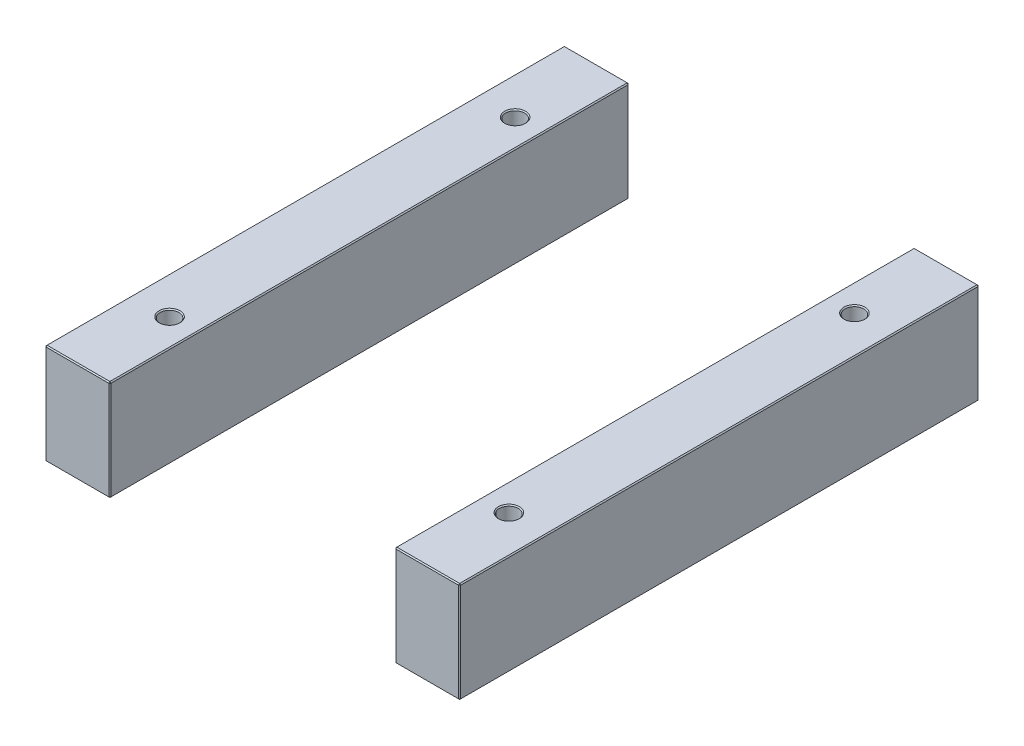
ISO-10303-21;
HEADER;
FILE_DESCRIPTION(('STEP AP214'),'2;1');
FILE_NAME('part.step','',(''),(''),'','','');
FILE_SCHEMA(('AUTOMOTIVE_DESIGN { 1 0 10303 214 1 1 1 1 }'));
ENDSEC;
DATA;
#1=APPLICATION_CONTEXT('core data for automotive mechanical design processes');
#2=APPLICATION_PROTOCOL_DEFINITION('international standard','automotive_design',2000,#1);
#3=PRODUCT_CONTEXT('',#1,'mechanical');
#4=PRODUCT('Part','Part','',(#3));
#5=PRODUCT_RELATED_PRODUCT_CATEGORY('part','',(#4));
#6=PRODUCT_DEFINITION_FORMATION('','',#4);
#7=PRODUCT_DEFINITION_CONTEXT('part definition',#1,'design');
#8=PRODUCT_DEFINITION('design','',#6,#7);
#9=PRODUCT_DEFINITION_SHAPE('','',#8);
#10=(LENGTH_UNIT() NAMED_UNIT(*) SI_UNIT(.MILLI.,.METRE.));
#11=(NAMED_UNIT(*) PLANE_ANGLE_UNIT() SI_UNIT($,.RADIAN.));
#12=(NAMED_UNIT(*) SI_UNIT($,.STERADIAN.) SOLID_ANGLE_UNIT());
#13=UNCERTAINTY_MEASURE_WITH_UNIT(LENGTH_MEASURE(1.E-05),#10,'distance_accuracy_value','');
#14=(GEOMETRIC_REPRESENTATION_CONTEXT(3) GLOBAL_UNCERTAINTY_ASSIGNED_CONTEXT((#13)) GLOBAL_UNIT_ASSIGNED_CONTEXT((#10,
#11,#12)) REPRESENTATION_CONTEXT('',''));
#15=CARTESIAN_POINT('',(0.,0.,0.));
#16=DIRECTION('',(0.,0.,1.));
#17=DIRECTION('',(1.,0.,0.));
#18=AXIS2_PLACEMENT_3D('',#15,#16,#17);
#19=CARTESIAN_POINT('',(-198.,96.,-248.));
#20=DIRECTION('',(0.,0.,1.));
#21=DIRECTION('',(1.,0.,0.));
#22=AXIS2_PLACEMENT_3D('',#19,#20,#21);
#23=PLANE('',#22);
#24=DIRECTION('',(-1.,0.,0.));
#25=VECTOR('',#24,1.);
#26=CARTESIAN_POINT('',(-198.,1.,-248.));
#27=LINE('',#26,#25);
#28=CARTESIAN_POINT('',(-137.,1.,-248.));
#29=VERTEX_POINT('',#28);
#30=CARTESIAN_POINT('',(-197.,1.,-248.));
#31=VERTEX_POINT('',#30);
#32=EDGE_CURVE('P0_E137',#29,#31,#27,.T.);
#33=ORIENTED_EDGE('',*,*,#32,.T.);
#34=DIRECTION('',(0.,1.,0.));
#35=VECTOR('',#34,1.);
#36=CARTESIAN_POINT('',(-197.,96.,-248.));
#37=LINE('',#36,#35);
#38=CARTESIAN_POINT('',(-197.,95.,-248.));
#39=VERTEX_POINT('',#38);
#40=EDGE_CURVE('P0_E235',#31,#39,#37,.T.);
#41=ORIENTED_EDGE('',*,*,#40,.T.);
#42=DIRECTION('',(1.,0.,0.));
#43=VECTOR('',#42,1.);
#44=CARTESIAN_POINT('',(-198.,95.,-248.));
#45=LINE('',#44,#43);
#46=CARTESIAN_POINT('',(-137.,95.,-248.));
#47=VERTEX_POINT('',#46);
#48=EDGE_CURVE('P0_E233',#39,#47,#45,.T.);
#49=ORIENTED_EDGE('',*,*,#48,.T.);
#50=DIRECTION('',(0.,-1.,0.));
#51=VECTOR('',#50,1.);
#52=CARTESIAN_POINT('',(-137.,96.,-248.));
#53=LINE('',#52,#51);
#54=EDGE_CURVE('P0_E230',#47,#29,#53,.T.);
#55=ORIENTED_EDGE('',*,*,#54,.T.);
#56=EDGE_LOOP('',(#33,#41,#49,#55));
#57=FACE_BOUND('',#56,.T.);
#58=ADVANCED_FACE('P0_F16',(#57),#23,.F.);
#59=CARTESIAN_POINT('',(-198.,96.,248.));
#60=DIRECTION('',(1.,0.,0.));
#61=DIRECTION('',(0.,0.,-1.));
#62=AXIS2_PLACEMENT_3D('',#59,#60,#61);
#63=PLANE('',#62);
#64=DIRECTION('',(0.,1.,0.));
#65=VECTOR('',#64,1.);
#66=CARTESIAN_POINT('',(-198.,96.,247.));
#67=LINE('',#66,#65);
#68=CARTESIAN_POINT('',(-198.,1.,247.));
#69=VERTEX_POINT('',#68);
#70=CARTESIAN_POINT('',(-198.,95.,247.));
#71=VERTEX_POINT('',#70);
#72=EDGE_CURVE('P0_E217',#69,#71,#67,.T.);
#73=ORIENTED_EDGE('',*,*,#72,.T.);
#74=DIRECTION('',(0.,0.,-1.));
#75=VECTOR('',#74,1.);
#76=CARTESIAN_POINT('',(-198.,95.,248.));
#77=LINE('',#76,#75);
#78=CARTESIAN_POINT('',(-198.,95.,-247.));
#79=VERTEX_POINT('',#78);
#80=EDGE_CURVE('P0_E228',#71,#79,#77,.T.);
#81=ORIENTED_EDGE('',*,*,#80,.T.);
#82=DIRECTION('',(0.,-1.,0.));
#83=VECTOR('',#82,1.);
#84=CARTESIAN_POINT('',(-198.,96.,-247.));
#85=LINE('',#84,#83);
#86=CARTESIAN_POINT('',(-198.,1.,-247.));
#87=VERTEX_POINT('',#86);
#88=EDGE_CURVE('P0_E225',#79,#87,#85,.T.);
#89=ORIENTED_EDGE('',*,*,#88,.T.);
#90=DIRECTION('',(0.,0.,1.));
#91=VECTOR('',#90,1.);
#92=CARTESIAN_POINT('',(-198.,1.,248.));
#93=LINE('',#92,#91);
#94=EDGE_CURVE('P0_E214',#87,#69,#93,.T.);
#95=ORIENTED_EDGE('',*,*,#94,.T.);
#96=EDGE_LOOP('',(#73,#81,#89,#95));
#97=FACE_BOUND('',#96,.T.);
#98=ADVANCED_FACE('P0_F302',(#97),#63,.F.);
#99=CARTESIAN_POINT('',(-198.,96.,248.));
#100=DIRECTION('',(0.,0.,-1.));
#101=DIRECTION('',(-1.,0.,0.));
#102=AXIS2_PLACEMENT_3D('',#99,#100,#101);
#103=PLANE('',#102);
#104=DIRECTION('',(-1.,0.,0.));
#105=VECTOR('',#104,1.);
#106=CARTESIAN_POINT('',(-198.,95.,248.));
#107=LINE('',#106,#105);
#108=CARTESIAN_POINT('',(-137.,95.,248.));
#109=VERTEX_POINT('',#108);
#110=CARTESIAN_POINT('',(-197.,95.,248.));
#111=VERTEX_POINT('',#110);
#112=EDGE_CURVE('P0_E242',#109,#111,#107,.T.);
#113=ORIENTED_EDGE('',*,*,#112,.T.);
#114=DIRECTION('',(0.,-1.,0.));
#115=VECTOR('',#114,1.);
#116=CARTESIAN_POINT('',(-197.,96.,248.));
#117=LINE('',#116,#115);
#118=CARTESIAN_POINT('',(-197.,1.,248.));
#119=VERTEX_POINT('',#118);
#120=EDGE_CURVE('P0_E244',#111,#119,#117,.T.);
#121=ORIENTED_EDGE('',*,*,#120,.T.);
#122=DIRECTION('',(1.,0.,0.));
#123=VECTOR('',#122,1.);
#124=CARTESIAN_POINT('',(-136.,1.,248.));
#125=LINE('',#124,#123);
#126=CARTESIAN_POINT('',(-137.,1.,248.));
#127=VERTEX_POINT('',#126);
#128=EDGE_CURVE('P0_E240',#119,#127,#125,.T.);
#129=ORIENTED_EDGE('',*,*,#128,.T.);
#130=DIRECTION('',(0.,1.,0.));
#131=VECTOR('',#130,1.);
#132=CARTESIAN_POINT('',(-137.,96.,248.));
#133=LINE('',#132,#131);
#134=EDGE_CURVE('P0_E238',#127,#109,#133,.T.);
#135=ORIENTED_EDGE('',*,*,#134,.T.);
#136=EDGE_LOOP('',(#113,#121,#129,#135));
#137=FACE_BOUND('',#136,.T.);
#138=ADVANCED_FACE('P0_F341',(#137),#103,.F.);
#139=CARTESIAN_POINT('',(-136.,96.,-248.));
#140=DIRECTION('',(-1.,0.,0.));
#141=DIRECTION('',(0.,0.,1.));
#142=AXIS2_PLACEMENT_3D('',#139,#140,#141);
#143=PLANE('',#142);
#144=DIRECTION('',(0.,0.,1.));
#145=VECTOR('',#144,1.);
#146=CARTESIAN_POINT('',(-136.,95.,-248.));
#147=LINE('',#146,#145);
#148=CARTESIAN_POINT('',(-136.,95.,-247.));
#149=VERTEX_POINT('',#148);
#150=CARTESIAN_POINT('',(-136.,95.,247.));
#151=VERTEX_POINT('',#150);
#152=EDGE_CURVE('P0_E31',#149,#151,#147,.T.);
#153=ORIENTED_EDGE('',*,*,#152,.T.);
#154=DIRECTION('',(0.,-1.,0.));
#155=VECTOR('',#154,1.);
#156=CARTESIAN_POINT('',(-136.,96.,247.));
#157=LINE('',#156,#155);
#158=CARTESIAN_POINT('',(-136.,1.,247.));
#159=VERTEX_POINT('',#158);
#160=EDGE_CURVE('P0_E190',#151,#159,#157,.T.);
#161=ORIENTED_EDGE('',*,*,#160,.T.);
#162=DIRECTION('',(0.,0.,-1.));
#163=VECTOR('',#162,1.);
#164=CARTESIAN_POINT('',(-136.,1.,-248.));
#165=LINE('',#164,#163);
#166=CARTESIAN_POINT('',(-136.,1.,-247.));
#167=VERTEX_POINT('',#166);
#168=EDGE_CURVE('P0_E256',#159,#167,#165,.T.);
#169=ORIENTED_EDGE('',*,*,#168,.T.);
#170=DIRECTION('',(0.,1.,0.));
#171=VECTOR('',#170,1.);
#172=CARTESIAN_POINT('',(-136.,96.,-247.));
#173=LINE('',#172,#171);
#174=EDGE_CURVE('P0_E36',#167,#149,#173,.T.);
#175=ORIENTED_EDGE('',*,*,#174,.T.);
#176=EDGE_LOOP('',(#153,#161,#169,#175));
#177=FACE_BOUND('',#176,.T.);
#178=ADVANCED_FACE('P0_F535',(#177),#143,.F.);
#179=CARTESIAN_POINT('',(0.,96.,0.));
#180=DIRECTION('',(0.,-1.,0.));
#181=DIRECTION('',(0.,0.,-1.));
#182=AXIS2_PLACEMENT_3D('',#179,#180,#181);
#183=PLANE('',#182);
#184=CARTESIAN_POINT('',(-162.,96.,165.));
#185=DIRECTION('',(0.,-1.,0.));
#186=DIRECTION('',(0.,0.,-1.));
#187=AXIS2_PLACEMENT_3D('',#184,#185,#186);
#188=CIRCLE('',#187,10.);
#189=CARTESIAN_POINT('',(-162.,96.,155.));
#190=VERTEX_POINT('',#189);
#191=EDGE_CURVE('P0_E24',#190,#190,#188,.T.);
#192=ORIENTED_EDGE('',*,*,#191,.T.);
#193=EDGE_LOOP('',(#192));
#194=FACE_BOUND('',#193,.T.);
#195=CARTESIAN_POINT('',(-162.,96.,-165.));
#196=DIRECTION('',(0.,-1.,0.));
#197=DIRECTION('',(0.,0.,-1.));
#198=AXIS2_PLACEMENT_3D('',#195,#196,#197);
#199=CIRCLE('',#198,10.);
#200=CARTESIAN_POINT('',(-162.,96.,-175.));
#201=VERTEX_POINT('',#200);
#202=EDGE_CURVE('P0_E189',#201,#201,#199,.T.);
#203=ORIENTED_EDGE('',*,*,#202,.T.);
#204=EDGE_LOOP('',(#203));
#205=FACE_BOUND('',#204,.T.);
#206=DIRECTION('',(0.,0.,1.));
#207=VECTOR('',#206,1.);
#208=CARTESIAN_POINT('',(-197.,96.,0.));
#209=LINE('',#208,#207);
#210=CARTESIAN_POINT('',(-197.,96.,-247.));
#211=VERTEX_POINT('',#210);
#212=CARTESIAN_POINT('',(-197.,96.,247.));
#213=VERTEX_POINT('',#212);
#214=EDGE_CURVE('P0_E251',#211,#213,#209,.T.);
#215=ORIENTED_EDGE('',*,*,#214,.T.);
#216=DIRECTION('',(1.,0.,0.));
#217=VECTOR('',#216,1.);
#218=CARTESIAN_POINT('',(0.,96.,247.));
#219=LINE('',#218,#217);
#220=CARTESIAN_POINT('',(-137.,96.,247.));
#221=VERTEX_POINT('',#220);
#222=EDGE_CURVE('P0_E253',#213,#221,#219,.T.);
#223=ORIENTED_EDGE('',*,*,#222,.T.);
#224=DIRECTION('',(0.,0.,-1.));
#225=VECTOR('',#224,1.);
#226=CARTESIAN_POINT('',(-137.,96.,0.));
#227=LINE('',#226,#225);
#228=CARTESIAN_POINT('',(-137.,96.,-247.));
#229=VERTEX_POINT('',#228);
#230=EDGE_CURVE('P0_E247',#221,#229,#227,.T.);
#231=ORIENTED_EDGE('',*,*,#230,.T.);
#232=DIRECTION('',(-1.,0.,0.));
#233=VECTOR('',#232,1.);
#234=CARTESIAN_POINT('',(0.,96.,-247.));
#235=LINE('',#234,#233);
#236=EDGE_CURVE('P0_E249',#229,#211,#235,.T.);
#237=ORIENTED_EDGE('',*,*,#236,.T.);
#238=EDGE_LOOP('',(#215,#223,#231,#237));
#239=FACE_BOUND('',#238,.T.);
#240=ADVANCED_FACE('P0_F195',(#194,#205,#239),#183,.F.);
#241=CARTESIAN_POINT('',(0.,0.,0.));
#242=DIRECTION('',(0.,-1.,0.));
#243=DIRECTION('',(0.,0.,-1.));
#244=AXIS2_PLACEMENT_3D('',#241,#242,#243);
#245=PLANE('',#244);
#246=CARTESIAN_POINT('',(-162.,0.,-165.));
#247=DIRECTION('',(0.,-1.,0.));
#248=DIRECTION('',(0.,0.,-1.));
#249=AXIS2_PLACEMENT_3D('',#246,#247,#248);
#250=CIRCLE('',#249,10.);
#251=CARTESIAN_POINT('',(-162.,0.,-175.));
#252=VERTEX_POINT('',#251);
#253=EDGE_CURVE('P0_E220',#252,#252,#250,.F.);
#254=ORIENTED_EDGE('',*,*,#253,.T.);
#255=EDGE_LOOP('',(#254));
#256=FACE_BOUND('',#255,.T.);
#257=CARTESIAN_POINT('',(-162.,0.,165.));
#258=DIRECTION('',(0.,-1.,0.));
#259=DIRECTION('',(0.,0.,-1.));
#260=AXIS2_PLACEMENT_3D('',#257,#258,#259);
#261=CIRCLE('',#260,10.);
#262=CARTESIAN_POINT('',(-162.,0.,155.));
#263=VERTEX_POINT('',#262);
#264=EDGE_CURVE('P0_E608',#263,#263,#261,.F.);
#265=ORIENTED_EDGE('',*,*,#264,.T.);
#266=EDGE_LOOP('',(#265));
#267=FACE_BOUND('',#266,.T.);
#268=DIRECTION('',(-1.,0.,0.));
#269=VECTOR('',#268,1.);
#270=CARTESIAN_POINT('',(-198.,0.,247.));
#271=LINE('',#270,#269);
#272=CARTESIAN_POINT('',(-137.,0.,247.));
#273=VERTEX_POINT('',#272);
#274=CARTESIAN_POINT('',(-197.,0.,247.));
#275=VERTEX_POINT('',#274);
#276=EDGE_CURVE('P0_E114',#273,#275,#271,.T.);
#277=ORIENTED_EDGE('',*,*,#276,.T.);
#278=DIRECTION('',(0.,0.,-1.));
#279=VECTOR('',#278,1.);
#280=CARTESIAN_POINT('',(-197.,0.,-248.));
#281=LINE('',#280,#279);
#282=CARTESIAN_POINT('',(-197.,0.,-247.));
#283=VERTEX_POINT('',#282);
#284=EDGE_CURVE('P0_E110',#275,#283,#281,.T.);
#285=ORIENTED_EDGE('',*,*,#284,.T.);
#286=DIRECTION('',(1.,0.,0.));
#287=VECTOR('',#286,1.);
#288=CARTESIAN_POINT('',(-136.,0.,-247.));
#289=LINE('',#288,#287);
#290=CARTESIAN_POINT('',(-137.,0.,-247.));
#291=VERTEX_POINT('',#290);
#292=EDGE_CURVE('P0_E104',#283,#291,#289,.T.);
#293=ORIENTED_EDGE('',*,*,#292,.T.);
#294=DIRECTION('',(0.,0.,1.));
#295=VECTOR('',#294,1.);
#296=CARTESIAN_POINT('',(-137.,0.,248.));
#297=LINE('',#296,#295);
#298=EDGE_CURVE('P0_E107',#291,#273,#297,.T.);
#299=ORIENTED_EDGE('',*,*,#298,.T.);
#300=EDGE_LOOP('',(#277,#285,#293,#299));
#301=FACE_BOUND('',#300,.T.);
#302=ADVANCED_FACE('P0_F106',(#256,#267,#301),#245,.T.);
#303=CARTESIAN_POINT('',(-162.,0.,-165.));
#304=DIRECTION('',(0.,1.,0.));
#305=DIRECTION('',(0.,0.,1.));
#306=AXIS2_PLACEMENT_3D('',#303,#304,#305);
#307=CYLINDRICAL_SURFACE('',#306,9.);
#308=CARTESIAN_POINT('',(-162.,95.,-165.));
#309=DIRECTION('',(0.,-1.,0.));
#310=DIRECTION('',(0.,0.,-1.));
#311=AXIS2_PLACEMENT_3D('',#308,#309,#310);
#312=CIRCLE('',#311,9.);
#313=CARTESIAN_POINT('',(-162.,95.,-174.));
#314=VERTEX_POINT('',#313);
#315=EDGE_CURVE('P0_E10',#314,#314,#312,.F.);
#316=ORIENTED_EDGE('',*,*,#315,.T.);
#317=EDGE_LOOP('',(#316));
#318=FACE_BOUND('',#317,.T.);
#319=CARTESIAN_POINT('',(-162.,0.999999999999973,-165.));
#320=DIRECTION('',(0.,-1.,0.));
#321=DIRECTION('',(0.,0.,-1.));
#322=AXIS2_PLACEMENT_3D('',#319,#320,#321);
#323=CIRCLE('',#322,9.);
#324=CARTESIAN_POINT('',(-162.,0.999999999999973,-174.));
#325=VERTEX_POINT('',#324);
#326=EDGE_CURVE('P0_E215',#325,#325,#323,.T.);
#327=ORIENTED_EDGE('',*,*,#326,.T.);
#328=EDGE_LOOP('',(#327));
#329=FACE_BOUND('',#328,.T.);
#330=ADVANCED_FACE('P0_F208',(#318,#329),#307,.F.);
#331=CARTESIAN_POINT('',(-162.,0.,165.));
#332=DIRECTION('',(0.,1.,0.));
#333=DIRECTION('',(0.,0.,1.));
#334=AXIS2_PLACEMENT_3D('',#331,#332,#333);
#335=CYLINDRICAL_SURFACE('',#334,9.);
#336=CARTESIAN_POINT('',(-162.,95.,165.));
#337=DIRECTION('',(0.,-1.,0.));
#338=DIRECTION('',(0.,0.,-1.));
#339=AXIS2_PLACEMENT_3D('',#336,#337,#338);
#340=CIRCLE('',#339,9.);
#341=CARTESIAN_POINT('',(-162.,95.,156.));
#342=VERTEX_POINT('',#341);
#343=EDGE_CURVE('P0_E186',#342,#342,#340,.F.);
#344=ORIENTED_EDGE('',*,*,#343,.T.);
#345=EDGE_LOOP('',(#344));
#346=FACE_BOUND('',#345,.T.);
#347=CARTESIAN_POINT('',(-162.,0.999999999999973,165.));
#348=DIRECTION('',(0.,-1.,0.));
#349=DIRECTION('',(0.,0.,-1.));
#350=AXIS2_PLACEMENT_3D('',#347,#348,#349);
#351=CIRCLE('',#350,9.);
#352=CARTESIAN_POINT('',(-162.,0.999999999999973,156.));
#353=VERTEX_POINT('',#352);
#354=EDGE_CURVE('P0_E212',#353,#353,#351,.T.);
#355=ORIENTED_EDGE('',*,*,#354,.T.);
#356=EDGE_LOOP('',(#355));
#357=FACE_BOUND('',#356,.T.);
#358=ADVANCED_FACE('P0_F204',(#346,#357),#335,.F.);
#359=CARTESIAN_POINT('',(-162.,0.,-165.));
#360=DIRECTION('',(0.,-1.,0.));
#361=DIRECTION('',(0.,0.,-1.));
#362=AXIS2_PLACEMENT_3D('',#359,#360,#361);
#363=CONICAL_SURFACE('',#362,10.,0.78539816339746);
#364=ORIENTED_EDGE('',*,*,#326,.F.);
#365=EDGE_LOOP('',(#364));
#366=FACE_BOUND('',#365,.T.);
#367=ORIENTED_EDGE('',*,*,#253,.F.);
#368=EDGE_LOOP('',(#367));
#369=FACE_BOUND('',#368,.T.);
#370=ADVANCED_FACE('P0_F207',(#366,#369),#363,.F.);
#371=CARTESIAN_POINT('',(-162.,0.,165.));
#372=DIRECTION('',(0.,-1.,0.));
#373=DIRECTION('',(0.,0.,-1.));
#374=AXIS2_PLACEMENT_3D('',#371,#372,#373);
#375=CONICAL_SURFACE('',#374,10.,0.78539816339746);
#376=ORIENTED_EDGE('',*,*,#354,.F.);
#377=EDGE_LOOP('',(#376));
#378=FACE_BOUND('',#377,.T.);
#379=ORIENTED_EDGE('',*,*,#264,.F.);
#380=EDGE_LOOP('',(#379));
#381=FACE_BOUND('',#380,.T.);
#382=ADVANCED_FACE('P0_F347',(#378,#381),#375,.F.);
#383=CARTESIAN_POINT('',(-136.,96.,247.));
#384=DIRECTION('',(-0.707106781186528,0.,-0.707106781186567));
#385=DIRECTION('',(0.,-1.,0.));
#386=AXIS2_PLACEMENT_3D('',#383,#384,#385);
#387=PLANE('',#386);
#388=DIRECTION('',(-0.707106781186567,0.,0.707106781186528));
#389=VECTOR('',#388,1.);
#390=CARTESIAN_POINT('',(-136.5,95.,247.5));
#391=LINE('',#390,#389);
#392=EDGE_CURVE('P0_E125',#109,#151,#391,.F.);
#393=ORIENTED_EDGE('',*,*,#392,.F.);
#394=ORIENTED_EDGE('',*,*,#134,.F.);
#395=DIRECTION('',(0.707106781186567,0.,-0.707106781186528));
#396=VECTOR('',#395,1.);
#397=CARTESIAN_POINT('',(-137.,1.,248.));
#398=LINE('',#397,#396);
#399=EDGE_CURVE('P0_E181',#159,#127,#398,.F.);
#400=ORIENTED_EDGE('',*,*,#399,.F.);
#401=ORIENTED_EDGE('',*,*,#160,.F.);
#402=EDGE_LOOP('',(#393,#394,#400,#401));
#403=FACE_BOUND('',#402,.T.);
#404=ADVANCED_FACE('P0_F351',(#403),#387,.F.);
#405=CARTESIAN_POINT('',(-137.,96.,247.));
#406=DIRECTION('',(0.577350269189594,0.577350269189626,0.577350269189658));
#407=DIRECTION('',(0.,-0.707106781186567,0.707106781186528));
#408=AXIS2_PLACEMENT_3D('',#405,#406,#407);
#409=PLANE('',#408);
#410=DIRECTION('',(0.,0.707106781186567,-0.707106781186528));
#411=VECTOR('',#410,1.);
#412=CARTESIAN_POINT('',(-137.,96.,247.));
#413=LINE('',#412,#411);
#414=EDGE_CURVE('P0_E175',#109,#221,#413,.T.);
#415=ORIENTED_EDGE('',*,*,#414,.F.);
#416=ORIENTED_EDGE('',*,*,#392,.T.);
#417=DIRECTION('',(0.707106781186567,-0.707106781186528,0.));
#418=VECTOR('',#417,1.);
#419=CARTESIAN_POINT('',(-137.,96.,247.));
#420=LINE('',#419,#418);
#421=EDGE_CURVE('P0_E178',#221,#151,#420,.T.);
#422=ORIENTED_EDGE('',*,*,#421,.F.);
#423=EDGE_LOOP('',(#415,#416,#422));
#424=FACE_BOUND('',#423,.T.);
#425=ADVANCED_FACE('P0_F487',(#424),#409,.T.);
#426=CARTESIAN_POINT('',(-137.,1.,248.));
#427=DIRECTION('',(0.577350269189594,-0.577350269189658,0.577350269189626));
#428=DIRECTION('',(0.,-0.707106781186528,-0.707106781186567));
#429=AXIS2_PLACEMENT_3D('',#426,#427,#428);
#430=PLANE('',#429);
#431=DIRECTION('',(0.707106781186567,0.707106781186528,0.));
#432=VECTOR('',#431,1.);
#433=CARTESIAN_POINT('',(-136.5,0.5,247.));
#434=LINE('',#433,#432);
#435=EDGE_CURVE('P0_E123',#159,#273,#434,.F.);
#436=ORIENTED_EDGE('',*,*,#435,.F.);
#437=ORIENTED_EDGE('',*,*,#399,.T.);
#438=DIRECTION('',(0.,-0.707106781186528,-0.707106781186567));
#439=VECTOR('',#438,1.);
#440=CARTESIAN_POINT('',(-137.,1.,248.));
#441=LINE('',#440,#439);
#442=EDGE_CURVE('P0_E172',#273,#127,#441,.F.);
#443=ORIENTED_EDGE('',*,*,#442,.F.);
#444=EDGE_LOOP('',(#436,#437,#443));
#445=FACE_BOUND('',#444,.T.);
#446=ADVANCED_FACE('P0_F478',(#445),#430,.T.);
#447=CARTESIAN_POINT('',(-137.,96.,0.));
#448=DIRECTION('',(-0.707106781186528,-0.707106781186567,0.));
#449=DIRECTION('',(0.,0.,-1.));
#450=AXIS2_PLACEMENT_3D('',#447,#448,#449);
#451=PLANE('',#450);
#452=ORIENTED_EDGE('',*,*,#421,.T.);
#453=ORIENTED_EDGE('',*,*,#152,.F.);
#454=DIRECTION('',(-0.707106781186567,0.707106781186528,0.));
#455=VECTOR('',#454,1.);
#456=CARTESIAN_POINT('',(-136.5,95.5,-247.));
#457=LINE('',#456,#455);
#458=EDGE_CURVE('P0_E165',#229,#149,#457,.F.);
#459=ORIENTED_EDGE('',*,*,#458,.F.);
#460=ORIENTED_EDGE('',*,*,#230,.F.);
#461=EDGE_LOOP('',(#452,#453,#459,#460));
#462=FACE_BOUND('',#461,.T.);
#463=ADVANCED_FACE('P0_F318',(#462),#451,.F.);
#464=CARTESIAN_POINT('',(0.,96.,247.));
#465=DIRECTION('',(0.,-0.707106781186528,-0.707106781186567));
#466=DIRECTION('',(1.,0.,0.));
#467=AXIS2_PLACEMENT_3D('',#464,#465,#466);
#468=PLANE('',#467);
#469=ORIENTED_EDGE('',*,*,#414,.T.);
#470=ORIENTED_EDGE('',*,*,#222,.F.);
#471=DIRECTION('',(0.,-0.707106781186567,0.707106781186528));
#472=VECTOR('',#471,1.);
#473=CARTESIAN_POINT('',(-197.,95.5,247.5));
#474=LINE('',#473,#472);
#475=EDGE_CURVE('P0_E162',#111,#213,#474,.F.);
#476=ORIENTED_EDGE('',*,*,#475,.F.);
#477=ORIENTED_EDGE('',*,*,#112,.F.);
#478=EDGE_LOOP('',(#469,#470,#476,#477));
#479=FACE_BOUND('',#478,.T.);
#480=ADVANCED_FACE('P0_F313',(#479),#468,.F.);
#481=CARTESIAN_POINT('',(-197.,96.,248.));
#482=DIRECTION('',(0.707106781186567,0.,-0.707106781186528));
#483=DIRECTION('',(0.,-1.,0.));
#484=AXIS2_PLACEMENT_3D('',#481,#482,#483);
#485=PLANE('',#484);
#486=DIRECTION('',(0.707106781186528,0.,0.707106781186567));
#487=VECTOR('',#486,1.);
#488=CARTESIAN_POINT('',(-197.,1.,248.));
#489=LINE('',#488,#487);
#490=EDGE_CURVE('P0_E156',#119,#69,#489,.F.);
#491=ORIENTED_EDGE('',*,*,#490,.F.);
#492=ORIENTED_EDGE('',*,*,#120,.F.);
#493=DIRECTION('',(-0.707106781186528,0.,-0.707106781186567));
#494=VECTOR('',#493,1.);
#495=CARTESIAN_POINT('',(-198.,95.,247.));
#496=LINE('',#495,#494);
#497=EDGE_CURVE('P0_E159',#71,#111,#496,.F.);
#498=ORIENTED_EDGE('',*,*,#497,.F.);
#499=ORIENTED_EDGE('',*,*,#72,.F.);
#500=EDGE_LOOP('',(#491,#492,#498,#499));
#501=FACE_BOUND('',#500,.T.);
#502=ADVANCED_FACE('P0_F307',(#501),#485,.F.);
#503=CARTESIAN_POINT('',(-198.,1.,248.));
#504=DIRECTION('',(0.,-0.707106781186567,0.707106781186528));
#505=DIRECTION('',(-1.,0.,0.));
#506=AXIS2_PLACEMENT_3D('',#503,#504,#505);
#507=PLANE('',#506);
#508=ORIENTED_EDGE('',*,*,#442,.T.);
#509=ORIENTED_EDGE('',*,*,#128,.F.);
#510=DIRECTION('',(0.,0.707106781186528,0.707106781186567));
#511=VECTOR('',#510,1.);
#512=CARTESIAN_POINT('',(-197.,1.,248.));
#513=LINE('',#512,#511);
#514=EDGE_CURVE('P0_E134',#275,#119,#513,.T.);
#515=ORIENTED_EDGE('',*,*,#514,.F.);
#516=ORIENTED_EDGE('',*,*,#276,.F.);
#517=EDGE_LOOP('',(#508,#509,#515,#516));
#518=FACE_BOUND('',#517,.T.);
#519=ADVANCED_FACE('P0_F333',(#518),#507,.T.);
#520=CARTESIAN_POINT('',(-136.,1.,-248.));
#521=DIRECTION('',(0.707106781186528,-0.707106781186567,0.));
#522=DIRECTION('',(0.,0.,1.));
#523=AXIS2_PLACEMENT_3D('',#520,#521,#522);
#524=PLANE('',#523);
#525=ORIENTED_EDGE('',*,*,#435,.T.);
#526=ORIENTED_EDGE('',*,*,#298,.F.);
#527=DIRECTION('',(-0.707106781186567,-0.707106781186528,0.));
#528=VECTOR('',#527,1.);
#529=CARTESIAN_POINT('',(-137.,0.,-247.));
#530=LINE('',#529,#528);
#531=EDGE_CURVE('P0_E120',#167,#291,#530,.T.);
#532=ORIENTED_EDGE('',*,*,#531,.F.);
#533=ORIENTED_EDGE('',*,*,#168,.F.);
#534=EDGE_LOOP('',(#525,#526,#532,#533));
#535=FACE_BOUND('',#534,.T.);
#536=ADVANCED_FACE('P0_F119',(#535),#524,.T.);
#537=CARTESIAN_POINT('',(-137.,96.,-248.));
#538=DIRECTION('',(-0.707106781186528,0.,0.707106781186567));
#539=DIRECTION('',(0.,-1.,0.));
#540=AXIS2_PLACEMENT_3D('',#537,#538,#539);
#541=PLANE('',#540);
#542=DIRECTION('',(0.707106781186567,0.,0.707106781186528));
#543=VECTOR('',#542,1.);
#544=CARTESIAN_POINT('',(-137.,95.,-248.));
#545=LINE('',#544,#543);
#546=EDGE_CURVE('P0_E168',#149,#47,#545,.F.);
#547=ORIENTED_EDGE('',*,*,#546,.F.);
#548=ORIENTED_EDGE('',*,*,#174,.F.);
#549=DIRECTION('',(-0.707106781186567,0.,-0.707106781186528));
#550=VECTOR('',#549,1.);
#551=CARTESIAN_POINT('',(-136.5,1.,-247.5));
#552=LINE('',#551,#550);
#553=EDGE_CURVE('P0_E133',#29,#167,#552,.F.);
#554=ORIENTED_EDGE('',*,*,#553,.F.);
#555=ORIENTED_EDGE('',*,*,#54,.F.);
#556=EDGE_LOOP('',(#547,#548,#554,#555));
#557=FACE_BOUND('',#556,.T.);
#558=ADVANCED_FACE('P0_F323',(#557),#541,.F.);
#559=CARTESIAN_POINT('',(-137.,95.,-248.));
#560=DIRECTION('',(0.577350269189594,0.577350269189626,-0.577350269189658));
#561=DIRECTION('',(0.,0.707106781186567,0.707106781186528));
#562=AXIS2_PLACEMENT_3D('',#559,#560,#561);
#563=PLANE('',#562);
#564=ORIENTED_EDGE('',*,*,#458,.T.);
#565=ORIENTED_EDGE('',*,*,#546,.T.);
#566=DIRECTION('',(0.,-0.707106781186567,-0.707106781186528));
#567=VECTOR('',#566,1.);
#568=CARTESIAN_POINT('',(-137.,95.,-248.));
#569=LINE('',#568,#567);
#570=EDGE_CURVE('P0_E151',#229,#47,#569,.T.);
#571=ORIENTED_EDGE('',*,*,#570,.F.);
#572=EDGE_LOOP('',(#564,#565,#571));
#573=FACE_BOUND('',#572,.T.);
#574=ADVANCED_FACE('P0_F321',(#573),#563,.T.);
#575=CARTESIAN_POINT('',(-198.,95.,247.));
#576=DIRECTION('',(-0.577350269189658,0.577350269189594,0.577350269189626));
#577=DIRECTION('',(0.707106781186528,0.,0.707106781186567));
#578=AXIS2_PLACEMENT_3D('',#575,#576,#577);
#579=PLANE('',#578);
#580=ORIENTED_EDGE('',*,*,#497,.T.);
#581=ORIENTED_EDGE('',*,*,#475,.T.);
#582=DIRECTION('',(0.707106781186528,0.707106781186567,0.));
#583=VECTOR('',#582,1.);
#584=CARTESIAN_POINT('',(-198.,95.,247.));
#585=LINE('',#584,#583);
#586=EDGE_CURVE('P0_E142',#71,#213,#585,.T.);
#587=ORIENTED_EDGE('',*,*,#586,.F.);
#588=EDGE_LOOP('',(#580,#581,#587));
#589=FACE_BOUND('',#588,.T.);
#590=ADVANCED_FACE('P0_F310',(#589),#579,.T.);
#591=CARTESIAN_POINT('',(-197.,1.,248.));
#592=DIRECTION('',(-0.577350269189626,-0.577350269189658,0.577350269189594));
#593=DIRECTION('',(0.707106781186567,-0.707106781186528,0.));
#594=AXIS2_PLACEMENT_3D('',#591,#592,#593);
#595=PLANE('',#594);
#596=ORIENTED_EDGE('',*,*,#514,.T.);
#597=ORIENTED_EDGE('',*,*,#490,.T.);
#598=DIRECTION('',(0.707106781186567,-0.707106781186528,0.));
#599=VECTOR('',#598,1.);
#600=CARTESIAN_POINT('',(-197.5,0.5,247.));
#601=LINE('',#600,#599);
#602=EDGE_CURVE('P0_E138',#275,#69,#601,.F.);
#603=ORIENTED_EDGE('',*,*,#602,.F.);
#604=EDGE_LOOP('',(#596,#597,#603));
#605=FACE_BOUND('',#604,.T.);
#606=ADVANCED_FACE('P0_F368',(#605),#595,.T.);
#607=CARTESIAN_POINT('',(-137.,0.,-247.));
#608=DIRECTION('',(0.577350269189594,-0.577350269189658,-0.577350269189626));
#609=DIRECTION('',(0.,0.707106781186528,-0.707106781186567));
#610=AXIS2_PLACEMENT_3D('',#607,#608,#609);
#611=PLANE('',#610);
#612=ORIENTED_EDGE('',*,*,#553,.T.);
#613=ORIENTED_EDGE('',*,*,#531,.T.);
#614=DIRECTION('',(0.,0.707106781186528,-0.707106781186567));
#615=VECTOR('',#614,1.);
#616=CARTESIAN_POINT('',(-137.,0.,-247.));
#617=LINE('',#616,#615);
#618=EDGE_CURVE('P0_E130',#29,#291,#617,.F.);
#619=ORIENTED_EDGE('',*,*,#618,.F.);
#620=EDGE_LOOP('',(#612,#613,#619));
#621=FACE_BOUND('',#620,.T.);
#622=ADVANCED_FACE('P0_F129',(#621),#611,.T.);
#623=CARTESIAN_POINT('',(0.,96.,-247.));
#624=DIRECTION('',(0.,-0.707106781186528,0.707106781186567));
#625=DIRECTION('',(-1.,0.,0.));
#626=AXIS2_PLACEMENT_3D('',#623,#624,#625);
#627=PLANE('',#626);
#628=ORIENTED_EDGE('',*,*,#570,.T.);
#629=ORIENTED_EDGE('',*,*,#48,.F.);
#630=DIRECTION('',(0.,0.707106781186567,0.707106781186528));
#631=VECTOR('',#630,1.);
#632=CARTESIAN_POINT('',(-197.,95.,-248.));
#633=LINE('',#632,#631);
#634=EDGE_CURVE('P0_E139',#211,#39,#633,.F.);
#635=ORIENTED_EDGE('',*,*,#634,.F.);
#636=ORIENTED_EDGE('',*,*,#236,.F.);
#637=EDGE_LOOP('',(#628,#629,#635,#636));
#638=FACE_BOUND('',#637,.T.);
#639=ADVANCED_FACE('P0_F286',(#638),#627,.F.);
#640=CARTESIAN_POINT('',(-197.,96.,0.));
#641=DIRECTION('',(0.707106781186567,-0.707106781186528,0.));
#642=DIRECTION('',(0.,0.,1.));
#643=AXIS2_PLACEMENT_3D('',#640,#641,#642);
#644=PLANE('',#643);
#645=ORIENTED_EDGE('',*,*,#586,.T.);
#646=ORIENTED_EDGE('',*,*,#214,.F.);
#647=DIRECTION('',(-0.707106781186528,-0.707106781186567,0.));
#648=VECTOR('',#647,1.);
#649=CARTESIAN_POINT('',(-197.5,95.5,-247.));
#650=LINE('',#649,#648);
#651=EDGE_CURVE('P0_E145',#79,#211,#650,.F.);
#652=ORIENTED_EDGE('',*,*,#651,.F.);
#653=ORIENTED_EDGE('',*,*,#80,.F.);
#654=EDGE_LOOP('',(#645,#646,#652,#653));
#655=FACE_BOUND('',#654,.T.);
#656=ADVANCED_FACE('P0_F280',(#655),#644,.F.);
#657=CARTESIAN_POINT('',(-198.,1.,248.));
#658=DIRECTION('',(-0.707106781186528,-0.707106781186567,0.));
#659=DIRECTION('',(0.,0.,-1.));
#660=AXIS2_PLACEMENT_3D('',#657,#658,#659);
#661=PLANE('',#660);
#662=ORIENTED_EDGE('',*,*,#602,.T.);
#663=ORIENTED_EDGE('',*,*,#94,.F.);
#664=DIRECTION('',(-0.707106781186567,0.707106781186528,0.));
#665=VECTOR('',#664,1.);
#666=CARTESIAN_POINT('',(-198.,1.,-247.));
#667=LINE('',#666,#665);
#668=EDGE_CURVE('P0_E267',#283,#87,#667,.T.);
#669=ORIENTED_EDGE('',*,*,#668,.F.);
#670=ORIENTED_EDGE('',*,*,#284,.F.);
#671=EDGE_LOOP('',(#662,#663,#669,#670));
#672=FACE_BOUND('',#671,.T.);
#673=ADVANCED_FACE('P0_F298',(#672),#661,.T.);
#674=CARTESIAN_POINT('',(-198.,1.,-248.));
#675=DIRECTION('',(0.,-0.707106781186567,-0.707106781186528));
#676=DIRECTION('',(1.,0.,0.));
#677=AXIS2_PLACEMENT_3D('',#674,#675,#676);
#678=PLANE('',#677);
#679=ORIENTED_EDGE('',*,*,#618,.T.);
#680=ORIENTED_EDGE('',*,*,#292,.F.);
#681=DIRECTION('',(0.,-0.707106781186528,0.707106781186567));
#682=VECTOR('',#681,1.);
#683=CARTESIAN_POINT('',(-197.,0.5,-247.5));
#684=LINE('',#683,#682);
#685=EDGE_CURVE('P0_E265',#31,#283,#684,.T.);
#686=ORIENTED_EDGE('',*,*,#685,.F.);
#687=ORIENTED_EDGE('',*,*,#32,.F.);
#688=EDGE_LOOP('',(#679,#680,#686,#687));
#689=FACE_BOUND('',#688,.T.);
#690=ADVANCED_FACE('P0_F136',(#689),#678,.T.);
#691=CARTESIAN_POINT('',(-197.,95.,-248.));
#692=DIRECTION('',(-0.577350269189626,0.577350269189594,-0.577350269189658));
#693=DIRECTION('',(-0.707106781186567,0.,0.707106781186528));
#694=AXIS2_PLACEMENT_3D('',#691,#692,#693);
#695=PLANE('',#694);
#696=ORIENTED_EDGE('',*,*,#651,.T.);
#697=ORIENTED_EDGE('',*,*,#634,.T.);
#698=DIRECTION('',(0.707106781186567,0.,-0.707106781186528));
#699=VECTOR('',#698,1.);
#700=CARTESIAN_POINT('',(-197.,95.,-248.));
#701=LINE('',#700,#699);
#702=EDGE_CURVE('P0_E263',#79,#39,#701,.T.);
#703=ORIENTED_EDGE('',*,*,#702,.F.);
#704=EDGE_LOOP('',(#696,#697,#703));
#705=FACE_BOUND('',#704,.T.);
#706=ADVANCED_FACE('P0_F273',(#705),#695,.T.);
#707=CARTESIAN_POINT('',(-198.,1.,-247.));
#708=DIRECTION('',(-0.577350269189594,-0.577350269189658,-0.577350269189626));
#709=DIRECTION('',(0.,0.707106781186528,-0.707106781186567));
#710=AXIS2_PLACEMENT_3D('',#707,#708,#709);
#711=PLANE('',#710);
#712=ORIENTED_EDGE('',*,*,#685,.T.);
#713=ORIENTED_EDGE('',*,*,#668,.T.);
#714=DIRECTION('',(-0.707106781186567,0.,0.707106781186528));
#715=VECTOR('',#714,1.);
#716=CARTESIAN_POINT('',(-198.,1.,-247.));
#717=LINE('',#716,#715);
#718=EDGE_CURVE('P0_E261',#31,#87,#717,.T.);
#719=ORIENTED_EDGE('',*,*,#718,.F.);
#720=EDGE_LOOP('',(#712,#713,#719));
#721=FACE_BOUND('',#720,.T.);
#722=ADVANCED_FACE('P0_F294',(#721),#711,.T.);
#723=CARTESIAN_POINT('',(-198.,96.,-247.));
#724=DIRECTION('',(0.707106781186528,0.,0.707106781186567));
#725=DIRECTION('',(0.,-1.,0.));
#726=AXIS2_PLACEMENT_3D('',#723,#724,#725);
#727=PLANE('',#726);
#728=ORIENTED_EDGE('',*,*,#702,.T.);
#729=ORIENTED_EDGE('',*,*,#40,.F.);
#730=ORIENTED_EDGE('',*,*,#718,.T.);
#731=ORIENTED_EDGE('',*,*,#88,.F.);
#732=EDGE_LOOP('',(#728,#729,#730,#731));
#733=FACE_BOUND('',#732,.T.);
#734=ADVANCED_FACE('P0_F201',(#733),#727,.F.);
#735=CARTESIAN_POINT('',(-162.,95.,165.));
#736=DIRECTION('',(0.,1.,0.));
#737=DIRECTION('',(0.,0.,1.));
#738=AXIS2_PLACEMENT_3D('',#735,#736,#737);
#739=CONICAL_SURFACE('',#738,9.,0.785398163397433);
#740=ORIENTED_EDGE('',*,*,#191,.F.);
#741=EDGE_LOOP('',(#740));
#742=FACE_BOUND('',#741,.T.);
#743=ORIENTED_EDGE('',*,*,#343,.F.);
#744=EDGE_LOOP('',(#743));
#745=FACE_BOUND('',#744,.T.);
#746=ADVANCED_FACE('P0_F198',(#742,#745),#739,.F.);
#747=CARTESIAN_POINT('',(-162.,95.,-165.));
#748=DIRECTION('',(0.,1.,0.));
#749=DIRECTION('',(0.,0.,1.));
#750=AXIS2_PLACEMENT_3D('',#747,#748,#749);
#751=CONICAL_SURFACE('',#750,9.,0.785398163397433);
#752=ORIENTED_EDGE('',*,*,#202,.F.);
#753=EDGE_LOOP('',(#752));
#754=FACE_BOUND('',#753,.T.);
#755=ORIENTED_EDGE('',*,*,#315,.F.);
#756=EDGE_LOOP('',(#755));
#757=FACE_BOUND('',#756,.T.);
#758=ADVANCED_FACE('P0_F18',(#754,#757),#751,.F.);
#759=CLOSED_SHELL('',(#58,#98,#138,#178,#240,#302,#330,#358,#370,#382,#404,#425,#446,#463,#480,
#502,#519,#536,#558,#574,#590,#606,#622,#639,#656,#673,#690,#706,#722,#734,#746,#758));
#760=MANIFOLD_SOLID_BREP('P0_B1',#759);
#761=CARTESIAN_POINT('',(198.,96.,248.));
#762=DIRECTION('',(0.,0.,-1.));
#763=DIRECTION('',(-1.,0.,0.));
#764=AXIS2_PLACEMENT_3D('',#761,#762,#763);
#765=PLANE('',#764);
#766=DIRECTION('',(0.,-1.,0.));
#767=VECTOR('',#766,1.);
#768=CARTESIAN_POINT('',(137.,96.,248.));
#769=LINE('',#768,#767);
#770=CARTESIAN_POINT('',(137.,95.,248.));
#771=VERTEX_POINT('',#770);
#772=CARTESIAN_POINT('',(137.,1.00000000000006,248.));
#773=VERTEX_POINT('',#772);
#774=EDGE_CURVE('P1_E174',#771,#773,#769,.T.);
#775=ORIENTED_EDGE('',*,*,#774,.T.);
#776=DIRECTION('',(1.,0.,0.));
#777=VECTOR('',#776,1.);
#778=CARTESIAN_POINT('',(198.,1.00000000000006,248.));
#779=LINE('',#778,#777);
#780=CARTESIAN_POINT('',(197.,1.00000000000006,248.));
#781=VERTEX_POINT('',#780);
#782=EDGE_CURVE('P1_E176',#773,#781,#779,.T.);
#783=ORIENTED_EDGE('',*,*,#782,.T.);
#784=DIRECTION('',(0.,1.,0.));
#785=VECTOR('',#784,1.);
#786=CARTESIAN_POINT('',(197.,96.,248.));
#787=LINE('',#786,#785);
#788=CARTESIAN_POINT('',(197.,95.,248.));
#789=VERTEX_POINT('',#788);
#790=EDGE_CURVE('P1_E172',#781,#789,#787,.T.);
#791=ORIENTED_EDGE('',*,*,#790,.T.);
#792=DIRECTION('',(-1.,0.,0.));
#793=VECTOR('',#792,1.);
#794=CARTESIAN_POINT('',(136.,95.,248.));
#795=LINE('',#794,#793);
#796=EDGE_CURVE('P1_E170',#789,#771,#795,.T.);
#797=ORIENTED_EDGE('',*,*,#796,.T.);
#798=EDGE_LOOP('',(#775,#783,#791,#797));
#799=FACE_BOUND('',#798,.T.);
#800=ADVANCED_FACE('P1_F17',(#799),#765,.F.);
#801=CARTESIAN_POINT('',(198.,96.,248.));
#802=DIRECTION('',(-1.,0.,0.));
#803=DIRECTION('',(0.,0.,1.));
#804=AXIS2_PLACEMENT_3D('',#801,#802,#803);
#805=PLANE('',#804);
#806=DIRECTION('',(0.,0.,1.));
#807=VECTOR('',#806,1.);
#808=CARTESIAN_POINT('',(198.,95.,248.));
#809=LINE('',#808,#807);
#810=CARTESIAN_POINT('',(198.,95.,-247.));
#811=VERTEX_POINT('',#810);
#812=CARTESIAN_POINT('',(198.,95.,247.));
#813=VERTEX_POINT('',#812);
#814=EDGE_CURVE('P1_E188',#811,#813,#809,.T.);
#815=ORIENTED_EDGE('',*,*,#814,.T.);
#816=DIRECTION('',(0.,-1.,0.));
#817=VECTOR('',#816,1.);
#818=CARTESIAN_POINT('',(198.,96.,247.));
#819=LINE('',#818,#817);
#820=CARTESIAN_POINT('',(198.,1.00000000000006,247.));
#821=VERTEX_POINT('',#820);
#822=EDGE_CURVE('P1_E194',#813,#821,#819,.T.);
#823=ORIENTED_EDGE('',*,*,#822,.T.);
#824=DIRECTION('',(0.,0.,-1.));
#825=VECTOR('',#824,1.);
#826=CARTESIAN_POINT('',(198.,1.00000000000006,248.));
#827=LINE('',#826,#825);
#828=CARTESIAN_POINT('',(198.,1.00000000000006,-247.));
#829=VERTEX_POINT('',#828);
#830=EDGE_CURVE('P1_E192',#821,#829,#827,.T.);
#831=ORIENTED_EDGE('',*,*,#830,.T.);
#832=DIRECTION('',(0.,1.,0.));
#833=VECTOR('',#832,1.);
#834=CARTESIAN_POINT('',(198.,96.,-247.));
#835=LINE('',#834,#833);
#836=EDGE_CURVE('P1_E190',#829,#811,#835,.T.);
#837=ORIENTED_EDGE('',*,*,#836,.T.);
#838=EDGE_LOOP('',(#815,#823,#831,#837));
#839=FACE_BOUND('',#838,.T.);
#840=ADVANCED_FACE('P1_F276',(#839),#805,.F.);
#841=CARTESIAN_POINT('',(198.,96.,-248.));
#842=DIRECTION('',(0.,0.,1.));
#843=DIRECTION('',(1.,0.,0.));
#844=AXIS2_PLACEMENT_3D('',#841,#842,#843);
#845=PLANE('',#844);
#846=DIRECTION('',(0.,-1.,0.));
#847=VECTOR('',#846,1.);
#848=CARTESIAN_POINT('',(197.,96.,-248.));
#849=LINE('',#848,#847);
#850=CARTESIAN_POINT('',(197.,95.,-248.));
#851=VERTEX_POINT('',#850);
#852=CARTESIAN_POINT('',(197.,1.00000000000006,-248.));
#853=VERTEX_POINT('',#852);
#854=EDGE_CURVE('P1_E165',#851,#853,#849,.T.);
#855=ORIENTED_EDGE('',*,*,#854,.T.);
#856=DIRECTION('',(-1.,0.,0.));
#857=VECTOR('',#856,1.);
#858=CARTESIAN_POINT('',(198.,1.00000000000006,-248.));
#859=LINE('',#858,#857);
#860=CARTESIAN_POINT('',(137.,1.00000000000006,-248.));
#861=VERTEX_POINT('',#860);
#862=EDGE_CURVE('P1_E113',#853,#861,#859,.T.);
#863=ORIENTED_EDGE('',*,*,#862,.T.);
#864=DIRECTION('',(0.,1.,0.));
#865=VECTOR('',#864,1.);
#866=CARTESIAN_POINT('',(137.,96.,-248.));
#867=LINE('',#866,#865);
#868=CARTESIAN_POINT('',(137.,95.,-248.));
#869=VERTEX_POINT('',#868);
#870=EDGE_CURVE('P1_E167',#861,#869,#867,.T.);
#871=ORIENTED_EDGE('',*,*,#870,.T.);
#872=DIRECTION('',(1.,0.,0.));
#873=VECTOR('',#872,1.);
#874=CARTESIAN_POINT('',(198.,95.,-248.));
#875=LINE('',#874,#873);
#876=EDGE_CURVE('P1_E163',#869,#851,#875,.T.);
#877=ORIENTED_EDGE('',*,*,#876,.T.);
#878=EDGE_LOOP('',(#855,#863,#871,#877));
#879=FACE_BOUND('',#878,.T.);
#880=ADVANCED_FACE('P1_F333',(#879),#845,.F.);
#881=CARTESIAN_POINT('',(136.,96.,-248.));
#882=DIRECTION('',(1.,0.,0.));
#883=DIRECTION('',(0.,0.,-1.));
#884=AXIS2_PLACEMENT_3D('',#881,#882,#883);
#885=PLANE('',#884);
#886=DIRECTION('',(0.,0.,-1.));
#887=VECTOR('',#886,1.);
#888=CARTESIAN_POINT('',(136.,95.,-248.));
#889=LINE('',#888,#887);
#890=CARTESIAN_POINT('',(136.,95.,247.));
#891=VERTEX_POINT('',#890);
#892=CARTESIAN_POINT('',(136.,95.,-247.));
#893=VERTEX_POINT('',#892);
#894=EDGE_CURVE('P1_E179',#891,#893,#889,.T.);
#895=ORIENTED_EDGE('',*,*,#894,.T.);
#896=DIRECTION('',(0.,-1.,0.));
#897=VECTOR('',#896,1.);
#898=CARTESIAN_POINT('',(136.,96.,-247.));
#899=LINE('',#898,#897);
#900=CARTESIAN_POINT('',(136.,1.00000000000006,-247.));
#901=VERTEX_POINT('',#900);
#902=EDGE_CURVE('P1_E185',#893,#901,#899,.T.);
#903=ORIENTED_EDGE('',*,*,#902,.T.);
#904=DIRECTION('',(0.,0.,1.));
#905=VECTOR('',#904,1.);
#906=CARTESIAN_POINT('',(136.,1.00000000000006,-248.));
#907=LINE('',#906,#905);
#908=CARTESIAN_POINT('',(136.,1.00000000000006,247.));
#909=VERTEX_POINT('',#908);
#910=EDGE_CURVE('P1_E183',#901,#909,#907,.T.);
#911=ORIENTED_EDGE('',*,*,#910,.T.);
#912=DIRECTION('',(0.,1.,0.));
#913=VECTOR('',#912,1.);
#914=CARTESIAN_POINT('',(136.,96.,247.));
#915=LINE('',#914,#913);
#916=EDGE_CURVE('P1_E181',#909,#891,#915,.T.);
#917=ORIENTED_EDGE('',*,*,#916,.T.);
#918=EDGE_LOOP('',(#895,#903,#911,#917));
#919=FACE_BOUND('',#918,.T.);
#920=ADVANCED_FACE('P1_F544',(#919),#885,.F.);
#921=CARTESIAN_POINT('',(0.,96.,0.));
#922=DIRECTION('',(0.,1.,0.));
#923=DIRECTION('',(0.,0.,1.));
#924=AXIS2_PLACEMENT_3D('',#921,#922,#923);
#925=PLANE('',#924);
#926=DIRECTION('',(-1.,0.,0.));
#927=VECTOR('',#926,1.);
#928=CARTESIAN_POINT('',(136.,96.,-247.));
#929=LINE('',#928,#927);
#930=CARTESIAN_POINT('',(197.,96.,-247.));
#931=VERTEX_POINT('',#930);
#932=CARTESIAN_POINT('',(137.,96.,-247.));
#933=VERTEX_POINT('',#932);
#934=EDGE_CURVE('P1_E26',#931,#933,#929,.T.);
#935=ORIENTED_EDGE('',*,*,#934,.T.);
#936=DIRECTION('',(0.,0.,1.));
#937=VECTOR('',#936,1.);
#938=CARTESIAN_POINT('',(137.,96.,248.));
#939=LINE('',#938,#937);
#940=CARTESIAN_POINT('',(137.,96.,247.));
#941=VERTEX_POINT('',#940);
#942=EDGE_CURVE('P1_E11',#933,#941,#939,.T.);
#943=ORIENTED_EDGE('',*,*,#942,.T.);
#944=DIRECTION('',(1.,0.,0.));
#945=VECTOR('',#944,1.);
#946=CARTESIAN_POINT('',(198.,96.,247.));
#947=LINE('',#946,#945);
#948=CARTESIAN_POINT('',(197.,96.,247.));
#949=VERTEX_POINT('',#948);
#950=EDGE_CURVE('P1_E203',#941,#949,#947,.T.);
#951=ORIENTED_EDGE('',*,*,#950,.T.);
#952=DIRECTION('',(0.,0.,-1.));
#953=VECTOR('',#952,1.);
#954=CARTESIAN_POINT('',(197.,96.,-248.));
#955=LINE('',#954,#953);
#956=EDGE_CURVE('P1_E37',#949,#931,#955,.T.);
#957=ORIENTED_EDGE('',*,*,#956,.T.);
#958=EDGE_LOOP('',(#935,#943,#951,#957));
#959=FACE_BOUND('',#958,.T.);
#960=CARTESIAN_POINT('',(162.,96.,-165.));
#961=DIRECTION('',(0.,1.,0.));
#962=DIRECTION('',(0.,0.,1.));
#963=AXIS2_PLACEMENT_3D('',#960,#961,#962);
#964=CIRCLE('',#963,10.);
#965=CARTESIAN_POINT('',(162.,96.,-155.));
#966=VERTEX_POINT('',#965);
#967=EDGE_CURVE('P1_E200',#966,#966,#964,.F.);
#968=ORIENTED_EDGE('',*,*,#967,.T.);
#969=EDGE_LOOP('',(#968));
#970=FACE_BOUND('',#969,.T.);
#971=CARTESIAN_POINT('',(162.,96.,165.));
#972=DIRECTION('',(0.,1.,0.));
#973=DIRECTION('',(0.,0.,1.));
#974=AXIS2_PLACEMENT_3D('',#971,#972,#973);
#975=CIRCLE('',#974,10.);
#976=CARTESIAN_POINT('',(162.,96.,175.));
#977=VERTEX_POINT('',#976);
#978=EDGE_CURVE('P1_E197',#977,#977,#975,.F.);
#979=ORIENTED_EDGE('',*,*,#978,.T.);
#980=EDGE_LOOP('',(#979));
#981=FACE_BOUND('',#980,.T.);
#982=ADVANCED_FACE('P1_F299',(#959,#970,#981),#925,.T.);
#983=CARTESIAN_POINT('',(0.,0.,0.));
#984=DIRECTION('',(0.,1.,0.));
#985=DIRECTION('',(0.,0.,1.));
#986=AXIS2_PLACEMENT_3D('',#983,#984,#985);
#987=PLANE('',#986);
#988=CARTESIAN_POINT('',(162.,0.,-165.));
#989=DIRECTION('',(0.,1.,0.));
#990=DIRECTION('',(0.,0.,1.));
#991=AXIS2_PLACEMENT_3D('',#988,#989,#990);
#992=CIRCLE('',#991,10.);
#993=CARTESIAN_POINT('',(162.,0.,-155.));
#994=VERTEX_POINT('',#993);
#995=EDGE_CURVE('P1_E148',#994,#994,#992,.T.);
#996=ORIENTED_EDGE('',*,*,#995,.T.);
#997=EDGE_LOOP('',(#996));
#998=FACE_BOUND('',#997,.T.);
#999=CARTESIAN_POINT('',(162.,0.,165.));
#1000=DIRECTION('',(0.,1.,0.));
#1001=DIRECTION('',(0.,0.,1.));
#1002=AXIS2_PLACEMENT_3D('',#999,#1000,#1001);
#1003=CIRCLE('',#1002,10.);
#1004=CARTESIAN_POINT('',(162.,0.,175.));
#1005=VERTEX_POINT('',#1004);
#1006=EDGE_CURVE('P1_E142',#1005,#1005,#1003,.T.);
#1007=ORIENTED_EDGE('',*,*,#1006,.T.);
#1008=EDGE_LOOP('',(#1007));
#1009=FACE_BOUND('',#1008,.T.);
#1010=DIRECTION('',(-1.,0.,0.));
#1011=VECTOR('',#1010,1.);
#1012=CARTESIAN_POINT('',(1.10574631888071E-13,0.,247.));
#1013=LINE('',#1012,#1011);
#1014=CARTESIAN_POINT('',(197.,0.,247.));
#1015=VERTEX_POINT('',#1014);
#1016=CARTESIAN_POINT('',(137.,0.,247.));
#1017=VERTEX_POINT('',#1016);
#1018=EDGE_CURVE('P1_E135',#1015,#1017,#1013,.T.);
#1019=ORIENTED_EDGE('',*,*,#1018,.T.);
#1020=DIRECTION('',(0.,0.,-1.));
#1021=VECTOR('',#1020,1.);
#1022=CARTESIAN_POINT('',(137.,0.,0.));
#1023=LINE('',#1022,#1021);
#1024=CARTESIAN_POINT('',(137.,0.,-247.));
#1025=VERTEX_POINT('',#1024);
#1026=EDGE_CURVE('P1_E139',#1017,#1025,#1023,.T.);
#1027=ORIENTED_EDGE('',*,*,#1026,.T.);
#1028=DIRECTION('',(1.,0.,0.));
#1029=VECTOR('',#1028,1.);
#1030=CARTESIAN_POINT('',(-9.95171686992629E-13,0.,-247.));
#1031=LINE('',#1030,#1029);
#1032=CARTESIAN_POINT('',(197.,0.,-247.));
#1033=VERTEX_POINT('',#1032);
#1034=EDGE_CURVE('P1_E110',#1025,#1033,#1031,.T.);
#1035=ORIENTED_EDGE('',*,*,#1034,.T.);
#1036=DIRECTION('',(0.,0.,1.));
#1037=VECTOR('',#1036,1.);
#1038=CARTESIAN_POINT('',(197.,0.,0.));
#1039=LINE('',#1038,#1037);
#1040=EDGE_CURVE('P1_E129',#1033,#1015,#1039,.T.);
#1041=ORIENTED_EDGE('',*,*,#1040,.T.);
#1042=EDGE_LOOP('',(#1019,#1027,#1035,#1041));
#1043=FACE_BOUND('',#1042,.T.);
#1044=ADVANCED_FACE('P1_F137',(#998,#1009,#1043),#987,.F.);
#1045=CARTESIAN_POINT('',(162.,0.,-165.));
#1046=DIRECTION('',(0.,1.,0.));
#1047=DIRECTION('',(0.,0.,1.));
#1048=AXIS2_PLACEMENT_3D('',#1045,#1046,#1047);
#1049=CYLINDRICAL_SURFACE('',#1048,9.);
#1050=CARTESIAN_POINT('',(162.,0.999999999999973,-165.));
#1051=DIRECTION('',(0.,1.,0.));
#1052=DIRECTION('',(0.,0.,1.));
#1053=AXIS2_PLACEMENT_3D('',#1050,#1051,#1052);
#1054=CIRCLE('',#1053,9.);
#1055=CARTESIAN_POINT('',(162.,0.999999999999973,-156.));
#1056=VERTEX_POINT('',#1055);
#1057=EDGE_CURVE('P1_E154',#1056,#1056,#1054,.F.);
#1058=ORIENTED_EDGE('',*,*,#1057,.T.);
#1059=EDGE_LOOP('',(#1058));
#1060=FACE_BOUND('',#1059,.T.);
#1061=CARTESIAN_POINT('',(162.,95.,-165.));
#1062=DIRECTION('',(0.,1.,0.));
#1063=DIRECTION('',(0.,0.,1.));
#1064=AXIS2_PLACEMENT_3D('',#1061,#1062,#1063);
#1065=CIRCLE('',#1064,9.);
#1066=CARTESIAN_POINT('',(162.,95.,-156.));
#1067=VERTEX_POINT('',#1066);
#1068=EDGE_CURVE('P1_E151',#1067,#1067,#1065,.T.);
#1069=ORIENTED_EDGE('',*,*,#1068,.T.);
#1070=EDGE_LOOP('',(#1069));
#1071=FACE_BOUND('',#1070,.T.);
#1072=ADVANCED_FACE('P1_F515',(#1060,#1071),#1049,.F.);
#1073=CARTESIAN_POINT('',(162.,0.,165.));
#1074=DIRECTION('',(0.,1.,0.));
#1075=DIRECTION('',(0.,0.,1.));
#1076=AXIS2_PLACEMENT_3D('',#1073,#1074,#1075);
#1077=CYLINDRICAL_SURFACE('',#1076,9.);
#1078=CARTESIAN_POINT('',(162.,0.999999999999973,165.));
#1079=DIRECTION('',(0.,1.,0.));
#1080=DIRECTION('',(0.,0.,1.));
#1081=AXIS2_PLACEMENT_3D('',#1078,#1079,#1080);
#1082=CIRCLE('',#1081,9.);
#1083=CARTESIAN_POINT('',(162.,0.999999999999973,174.));
#1084=VERTEX_POINT('',#1083);
#1085=EDGE_CURVE('P1_E160',#1084,#1084,#1082,.F.);
#1086=ORIENTED_EDGE('',*,*,#1085,.T.);
#1087=EDGE_LOOP('',(#1086));
#1088=FACE_BOUND('',#1087,.T.);
#1089=CARTESIAN_POINT('',(162.,95.,165.));
#1090=DIRECTION('',(0.,1.,0.));
#1091=DIRECTION('',(0.,0.,1.));
#1092=AXIS2_PLACEMENT_3D('',#1089,#1090,#1091);
#1093=CIRCLE('',#1092,9.);
#1094=CARTESIAN_POINT('',(162.,95.,174.));
#1095=VERTEX_POINT('',#1094);
#1096=EDGE_CURVE('P1_E157',#1095,#1095,#1093,.T.);
#1097=ORIENTED_EDGE('',*,*,#1096,.T.);
#1098=EDGE_LOOP('',(#1097));
#1099=FACE_BOUND('',#1098,.T.);
#1100=ADVANCED_FACE('P1_F341',(#1088,#1099),#1077,.F.);
#1101=CARTESIAN_POINT('',(162.,0.,-165.));
#1102=DIRECTION('',(0.,-1.,0.));
#1103=DIRECTION('',(0.,0.,-1.));
#1104=AXIS2_PLACEMENT_3D('',#1101,#1102,#1103);
#1105=CONICAL_SURFACE('',#1104,10.,0.78539816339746);
#1106=ORIENTED_EDGE('',*,*,#1057,.F.);
#1107=EDGE_LOOP('',(#1106));
#1108=FACE_BOUND('',#1107,.T.);
#1109=ORIENTED_EDGE('',*,*,#995,.F.);
#1110=EDGE_LOOP('',(#1109));
#1111=FACE_BOUND('',#1110,.T.);
#1112=ADVANCED_FACE('P1_F337',(#1108,#1111),#1105,.F.);
#1113=CARTESIAN_POINT('',(162.,0.,165.));
#1114=DIRECTION('',(0.,-1.,0.));
#1115=DIRECTION('',(0.,0.,-1.));
#1116=AXIS2_PLACEMENT_3D('',#1113,#1114,#1115);
#1117=CONICAL_SURFACE('',#1116,10.,0.78539816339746);
#1118=ORIENTED_EDGE('',*,*,#1085,.F.);
#1119=EDGE_LOOP('',(#1118));
#1120=FACE_BOUND('',#1119,.T.);
#1121=ORIENTED_EDGE('',*,*,#1006,.F.);
#1122=EDGE_LOOP('',(#1121));
#1123=FACE_BOUND('',#1122,.T.);
#1124=ADVANCED_FACE('P1_F340',(#1120,#1123),#1117,.F.);
#1125=CARTESIAN_POINT('',(1.10574631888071E-13,96.,247.));
#1126=DIRECTION('',(0.,0.70710678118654,0.707106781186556));
#1127=DIRECTION('',(-1.,0.,0.));
#1128=AXIS2_PLACEMENT_3D('',#1125,#1126,#1127);
#1129=PLANE('',#1128);
#1130=DIRECTION('',(0.,-0.707106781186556,0.70710678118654));
#1131=VECTOR('',#1130,1.);
#1132=CARTESIAN_POINT('',(197.,95.,248.));
#1133=LINE('',#1132,#1131);
#1134=EDGE_CURVE('P1_E21',#949,#789,#1133,.T.);
#1135=ORIENTED_EDGE('',*,*,#1134,.F.);
#1136=ORIENTED_EDGE('',*,*,#950,.F.);
#1137=DIRECTION('',(0.,0.707106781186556,-0.70710678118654));
#1138=VECTOR('',#1137,1.);
#1139=CARTESIAN_POINT('',(137.,95.5,247.5));
#1140=LINE('',#1139,#1138);
#1141=EDGE_CURVE('P1_E255',#771,#941,#1140,.T.);
#1142=ORIENTED_EDGE('',*,*,#1141,.F.);
#1143=ORIENTED_EDGE('',*,*,#796,.F.);
#1144=EDGE_LOOP('',(#1135,#1136,#1142,#1143));
#1145=FACE_BOUND('',#1144,.T.);
#1146=ADVANCED_FACE('P1_F301',(#1145),#1129,.T.);
#1147=CARTESIAN_POINT('',(197.,95.,248.));
#1148=DIRECTION('',(0.577350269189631,0.577350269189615,0.577350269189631));
#1149=DIRECTION('',(0.707106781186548,0.,-0.707106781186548));
#1150=AXIS2_PLACEMENT_3D('',#1147,#1148,#1149);
#1151=PLANE('',#1150);
#1152=DIRECTION('',(-0.707106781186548,0.707106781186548,0.));
#1153=VECTOR('',#1152,1.);
#1154=CARTESIAN_POINT('',(197.5,95.5,247.));
#1155=LINE('',#1154,#1153);
#1156=EDGE_CURVE('P1_E250',#949,#813,#1155,.F.);
#1157=ORIENTED_EDGE('',*,*,#1156,.F.);
#1158=ORIENTED_EDGE('',*,*,#1134,.T.);
#1159=DIRECTION('',(-0.707106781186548,0.,0.707106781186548));
#1160=VECTOR('',#1159,1.);
#1161=CARTESIAN_POINT('',(197.,95.,248.));
#1162=LINE('',#1161,#1160);
#1163=EDGE_CURVE('P1_E253',#813,#789,#1162,.T.);
#1164=ORIENTED_EDGE('',*,*,#1163,.F.);
#1165=EDGE_LOOP('',(#1157,#1158,#1164));
#1166=FACE_BOUND('',#1165,.T.);
#1167=ADVANCED_FACE('P1_F267',(#1166),#1151,.T.);
#1168=CARTESIAN_POINT('',(136.,95.,247.));
#1169=DIRECTION('',(-0.577350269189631,0.577350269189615,0.577350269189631));
#1170=DIRECTION('',(0.707106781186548,0.,0.707106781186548));
#1171=AXIS2_PLACEMENT_3D('',#1168,#1169,#1170);
#1172=PLANE('',#1171);
#1173=DIRECTION('',(-0.707106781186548,0.,-0.707106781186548));
#1174=VECTOR('',#1173,1.);
#1175=CARTESIAN_POINT('',(136.,95.,247.));
#1176=LINE('',#1175,#1174);
#1177=EDGE_CURVE('P1_E245',#771,#891,#1176,.T.);
#1178=ORIENTED_EDGE('',*,*,#1177,.F.);
#1179=ORIENTED_EDGE('',*,*,#1141,.T.);
#1180=DIRECTION('',(-0.707106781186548,-0.707106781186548,0.));
#1181=VECTOR('',#1180,1.);
#1182=CARTESIAN_POINT('',(136.,95.,247.));
#1183=LINE('',#1182,#1181);
#1184=EDGE_CURVE('P1_E248',#891,#941,#1183,.F.);
#1185=ORIENTED_EDGE('',*,*,#1184,.F.);
#1186=EDGE_LOOP('',(#1178,#1179,#1185));
#1187=FACE_BOUND('',#1186,.T.);
#1188=ADVANCED_FACE('P1_F303',(#1187),#1172,.T.);
#1189=CARTESIAN_POINT('',(198.,96.,247.));
#1190=DIRECTION('',(-0.707106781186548,0.,-0.707106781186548));
#1191=DIRECTION('',(0.,-1.,0.));
#1192=AXIS2_PLACEMENT_3D('',#1189,#1190,#1191);
#1193=PLANE('',#1192);
#1194=ORIENTED_EDGE('',*,*,#1163,.T.);
#1195=ORIENTED_EDGE('',*,*,#790,.F.);
#1196=DIRECTION('',(0.707106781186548,0.,-0.707106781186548));
#1197=VECTOR('',#1196,1.);
#1198=CARTESIAN_POINT('',(197.,1.00000000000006,248.));
#1199=LINE('',#1198,#1197);
#1200=EDGE_CURVE('P1_E240',#821,#781,#1199,.F.);
#1201=ORIENTED_EDGE('',*,*,#1200,.F.);
#1202=ORIENTED_EDGE('',*,*,#822,.F.);
#1203=EDGE_LOOP('',(#1194,#1195,#1201,#1202));
#1204=FACE_BOUND('',#1203,.T.);
#1205=ADVANCED_FACE('P1_F273',(#1204),#1193,.F.);
#1206=CARTESIAN_POINT('',(197.,96.,0.));
#1207=DIRECTION('',(0.707106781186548,0.707106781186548,0.));
#1208=DIRECTION('',(0.,0.,1.));
#1209=AXIS2_PLACEMENT_3D('',#1206,#1207,#1208);
#1210=PLANE('',#1209);
#1211=ORIENTED_EDGE('',*,*,#1156,.T.);
#1212=ORIENTED_EDGE('',*,*,#814,.F.);
#1213=DIRECTION('',(0.707106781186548,-0.707106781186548,0.));
#1214=VECTOR('',#1213,1.);
#1215=CARTESIAN_POINT('',(198.,95.,-247.));
#1216=LINE('',#1215,#1214);
#1217=EDGE_CURVE('P1_E237',#931,#811,#1216,.T.);
#1218=ORIENTED_EDGE('',*,*,#1217,.F.);
#1219=ORIENTED_EDGE('',*,*,#956,.F.);
#1220=EDGE_LOOP('',(#1211,#1212,#1218,#1219));
#1221=FACE_BOUND('',#1220,.T.);
#1222=ADVANCED_FACE('P1_F281',(#1221),#1210,.T.);
#1223=CARTESIAN_POINT('',(-9.95171686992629E-13,96.,-247.));
#1224=DIRECTION('',(0.,0.70710678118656,-0.707106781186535));
#1225=DIRECTION('',(1.,0.,0.));
#1226=AXIS2_PLACEMENT_3D('',#1223,#1224,#1225);
#1227=PLANE('',#1226);
#1228=DIRECTION('',(0.,-0.707106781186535,-0.70710678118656));
#1229=VECTOR('',#1228,1.);
#1230=CARTESIAN_POINT('',(137.,95.,-248.));
#1231=LINE('',#1230,#1229);
#1232=EDGE_CURVE('P1_E231',#933,#869,#1231,.T.);
#1233=ORIENTED_EDGE('',*,*,#1232,.F.);
#1234=ORIENTED_EDGE('',*,*,#934,.F.);
#1235=DIRECTION('',(0.,0.707106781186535,0.70710678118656));
#1236=VECTOR('',#1235,1.);
#1237=CARTESIAN_POINT('',(197.,95.5,-247.5));
#1238=LINE('',#1237,#1236);
#1239=EDGE_CURVE('P1_E234',#851,#931,#1238,.T.);
#1240=ORIENTED_EDGE('',*,*,#1239,.F.);
#1241=ORIENTED_EDGE('',*,*,#876,.F.);
#1242=EDGE_LOOP('',(#1233,#1234,#1240,#1241));
#1243=FACE_BOUND('',#1242,.T.);
#1244=ADVANCED_FACE('P1_F290',(#1243),#1227,.T.);
#1245=CARTESIAN_POINT('',(137.,96.,0.));
#1246=DIRECTION('',(-0.707106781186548,0.707106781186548,0.));
#1247=DIRECTION('',(0.,0.,-1.));
#1248=AXIS2_PLACEMENT_3D('',#1245,#1246,#1247);
#1249=PLANE('',#1248);
#1250=ORIENTED_EDGE('',*,*,#1184,.T.);
#1251=ORIENTED_EDGE('',*,*,#942,.F.);
#1252=DIRECTION('',(0.707106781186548,0.707106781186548,0.));
#1253=VECTOR('',#1252,1.);
#1254=CARTESIAN_POINT('',(136.5,95.5,-247.));
#1255=LINE('',#1254,#1253);
#1256=EDGE_CURVE('P1_E228',#893,#933,#1255,.T.);
#1257=ORIENTED_EDGE('',*,*,#1256,.F.);
#1258=ORIENTED_EDGE('',*,*,#894,.F.);
#1259=EDGE_LOOP('',(#1250,#1251,#1257,#1258));
#1260=FACE_BOUND('',#1259,.T.);
#1261=ADVANCED_FACE('P1_F298',(#1260),#1249,.T.);
#1262=CARTESIAN_POINT('',(137.,96.,248.));
#1263=DIRECTION('',(0.707106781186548,0.,-0.707106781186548));
#1264=DIRECTION('',(0.,-1.,0.));
#1265=AXIS2_PLACEMENT_3D('',#1262,#1263,#1264);
#1266=PLANE('',#1265);
#1267=ORIENTED_EDGE('',*,*,#1177,.T.);
#1268=ORIENTED_EDGE('',*,*,#916,.F.);
#1269=DIRECTION('',(0.707106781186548,0.,0.707106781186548));
#1270=VECTOR('',#1269,1.);
#1271=CARTESIAN_POINT('',(136.5,1.00000000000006,247.5));
#1272=LINE('',#1271,#1270);
#1273=EDGE_CURVE('P1_E225',#773,#909,#1272,.F.);
#1274=ORIENTED_EDGE('',*,*,#1273,.F.);
#1275=ORIENTED_EDGE('',*,*,#774,.F.);
#1276=EDGE_LOOP('',(#1267,#1268,#1274,#1275));
#1277=FACE_BOUND('',#1276,.T.);
#1278=ADVANCED_FACE('P1_F307',(#1277),#1266,.F.);
#1279=CARTESIAN_POINT('',(198.,1.00000000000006,248.));
#1280=DIRECTION('',(0.,0.70710678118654,-0.707106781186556));
#1281=DIRECTION('',(1.,0.,0.));
#1282=AXIS2_PLACEMENT_3D('',#1279,#1280,#1281);
#1283=PLANE('',#1282);
#1284=DIRECTION('',(0.,0.707106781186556,0.70710678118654));
#1285=VECTOR('',#1284,1.);
#1286=CARTESIAN_POINT('',(197.,1.00000000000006,248.));
#1287=LINE('',#1286,#1285);
#1288=EDGE_CURVE('P1_E242',#781,#1015,#1287,.F.);
#1289=ORIENTED_EDGE('',*,*,#1288,.F.);
#1290=ORIENTED_EDGE('',*,*,#782,.F.);
#1291=DIRECTION('',(0.,-0.707106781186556,-0.70710678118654));
#1292=VECTOR('',#1291,1.);
#1293=CARTESIAN_POINT('',(137.,0.,247.));
#1294=LINE('',#1293,#1292);
#1295=EDGE_CURVE('P1_E222',#1017,#773,#1294,.F.);
#1296=ORIENTED_EDGE('',*,*,#1295,.F.);
#1297=ORIENTED_EDGE('',*,*,#1018,.F.);
#1298=EDGE_LOOP('',(#1289,#1290,#1296,#1297));
#1299=FACE_BOUND('',#1298,.T.);
#1300=ADVANCED_FACE('P1_F313',(#1299),#1283,.F.);
#1301=CARTESIAN_POINT('',(197.,1.00000000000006,248.));
#1302=DIRECTION('',(0.577350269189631,-0.577350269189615,0.577350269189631));
#1303=DIRECTION('',(0.707106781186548,0.,-0.707106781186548));
#1304=AXIS2_PLACEMENT_3D('',#1301,#1302,#1303);
#1305=PLANE('',#1304);
#1306=ORIENTED_EDGE('',*,*,#1200,.T.);
#1307=ORIENTED_EDGE('',*,*,#1288,.T.);
#1308=DIRECTION('',(-0.707106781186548,-0.707106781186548,0.));
#1309=VECTOR('',#1308,1.);
#1310=CARTESIAN_POINT('',(197.5,0.500000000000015,247.));
#1311=LINE('',#1310,#1309);
#1312=EDGE_CURVE('P1_E132',#821,#1015,#1311,.T.);
#1313=ORIENTED_EDGE('',*,*,#1312,.F.);
#1314=EDGE_LOOP('',(#1306,#1307,#1313));
#1315=FACE_BOUND('',#1314,.T.);
#1316=ADVANCED_FACE('P1_F316',(#1315),#1305,.T.);
#1317=CARTESIAN_POINT('',(198.,95.,-247.));
#1318=DIRECTION('',(0.57735026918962,0.577350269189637,-0.57735026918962));
#1319=DIRECTION('',(0.,0.707106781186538,0.707106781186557));
#1320=AXIS2_PLACEMENT_3D('',#1317,#1318,#1319);
#1321=PLANE('',#1320);
#1322=ORIENTED_EDGE('',*,*,#1239,.T.);
#1323=ORIENTED_EDGE('',*,*,#1217,.T.);
#1324=DIRECTION('',(0.707106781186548,0.,0.707106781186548));
#1325=VECTOR('',#1324,1.);
#1326=CARTESIAN_POINT('',(198.,95.,-247.));
#1327=LINE('',#1326,#1325);
#1328=EDGE_CURVE('P1_E218',#851,#811,#1327,.T.);
#1329=ORIENTED_EDGE('',*,*,#1328,.F.);
#1330=EDGE_LOOP('',(#1322,#1323,#1329));
#1331=FACE_BOUND('',#1330,.T.);
#1332=ADVANCED_FACE('P1_F285',(#1331),#1321,.T.);
#1333=CARTESIAN_POINT('',(137.,95.,-248.));
#1334=DIRECTION('',(-0.57735026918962,0.577350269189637,-0.57735026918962));
#1335=DIRECTION('',(0.,0.707106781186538,0.707106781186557));
#1336=AXIS2_PLACEMENT_3D('',#1333,#1334,#1335);
#1337=PLANE('',#1336);
#1338=ORIENTED_EDGE('',*,*,#1256,.T.);
#1339=ORIENTED_EDGE('',*,*,#1232,.T.);
#1340=DIRECTION('',(0.707106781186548,0.,-0.707106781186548));
#1341=VECTOR('',#1340,1.);
#1342=CARTESIAN_POINT('',(137.,95.,-248.));
#1343=LINE('',#1342,#1341);
#1344=EDGE_CURVE('P1_E215',#893,#869,#1343,.T.);
#1345=ORIENTED_EDGE('',*,*,#1344,.F.);
#1346=EDGE_LOOP('',(#1338,#1339,#1345));
#1347=FACE_BOUND('',#1346,.T.);
#1348=ADVANCED_FACE('P1_F294',(#1347),#1337,.T.);
#1349=CARTESIAN_POINT('',(137.,0.,247.));
#1350=DIRECTION('',(-0.577350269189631,-0.577350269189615,0.577350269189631));
#1351=DIRECTION('',(0.707106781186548,0.,0.707106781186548));
#1352=AXIS2_PLACEMENT_3D('',#1349,#1350,#1351);
#1353=PLANE('',#1352);
#1354=ORIENTED_EDGE('',*,*,#1295,.T.);
#1355=ORIENTED_EDGE('',*,*,#1273,.T.);
#1356=DIRECTION('',(-0.707106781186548,0.707106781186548,0.));
#1357=VECTOR('',#1356,1.);
#1358=CARTESIAN_POINT('',(137.,0.,247.));
#1359=LINE('',#1358,#1357);
#1360=EDGE_CURVE('P1_E126',#1017,#909,#1359,.T.);
#1361=ORIENTED_EDGE('',*,*,#1360,.F.);
#1362=EDGE_LOOP('',(#1354,#1355,#1361));
#1363=FACE_BOUND('',#1362,.T.);
#1364=ADVANCED_FACE('P1_F369',(#1363),#1353,.T.);
#1365=CARTESIAN_POINT('',(198.,1.00000000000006,248.));
#1366=DIRECTION('',(-0.707106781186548,0.707106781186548,0.));
#1367=DIRECTION('',(0.,0.,-1.));
#1368=AXIS2_PLACEMENT_3D('',#1365,#1366,#1367);
#1369=PLANE('',#1368);
#1370=ORIENTED_EDGE('',*,*,#1312,.T.);
#1371=ORIENTED_EDGE('',*,*,#1040,.F.);
#1372=DIRECTION('',(0.707106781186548,0.707106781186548,0.));
#1373=VECTOR('',#1372,1.);
#1374=CARTESIAN_POINT('',(197.,0.,-247.));
#1375=LINE('',#1374,#1373);
#1376=EDGE_CURVE('P1_E120',#829,#1033,#1375,.F.);
#1377=ORIENTED_EDGE('',*,*,#1376,.F.);
#1378=ORIENTED_EDGE('',*,*,#830,.F.);
#1379=EDGE_LOOP('',(#1370,#1371,#1377,#1378));
#1380=FACE_BOUND('',#1379,.T.);
#1381=ADVANCED_FACE('P1_F130',(#1380),#1369,.F.);
#1382=CARTESIAN_POINT('',(197.,96.,-248.));
#1383=DIRECTION('',(-0.707106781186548,0.,0.707106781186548));
#1384=DIRECTION('',(0.,-1.,0.));
#1385=AXIS2_PLACEMENT_3D('',#1382,#1383,#1384);
#1386=PLANE('',#1385);
#1387=ORIENTED_EDGE('',*,*,#1328,.T.);
#1388=ORIENTED_EDGE('',*,*,#836,.F.);
#1389=DIRECTION('',(-0.707106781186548,0.,-0.707106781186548));
#1390=VECTOR('',#1389,1.);
#1391=CARTESIAN_POINT('',(197.5,1.00000000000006,-247.5));
#1392=LINE('',#1391,#1390);
#1393=EDGE_CURVE('P1_E124',#853,#829,#1392,.F.);
#1394=ORIENTED_EDGE('',*,*,#1393,.F.);
#1395=ORIENTED_EDGE('',*,*,#854,.F.);
#1396=EDGE_LOOP('',(#1387,#1388,#1394,#1395));
#1397=FACE_BOUND('',#1396,.T.);
#1398=ADVANCED_FACE('P1_F362',(#1397),#1386,.F.);
#1399=CARTESIAN_POINT('',(136.,96.,-247.));
#1400=DIRECTION('',(0.707106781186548,0.,0.707106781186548));
#1401=DIRECTION('',(0.,-1.,0.));
#1402=AXIS2_PLACEMENT_3D('',#1399,#1400,#1401);
#1403=PLANE('',#1402);
#1404=ORIENTED_EDGE('',*,*,#1344,.T.);
#1405=ORIENTED_EDGE('',*,*,#870,.F.);
#1406=DIRECTION('',(-0.707106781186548,0.,0.707106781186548));
#1407=VECTOR('',#1406,1.);
#1408=CARTESIAN_POINT('',(137.,1.00000000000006,-248.));
#1409=LINE('',#1408,#1407);
#1410=EDGE_CURVE('P1_E209',#901,#861,#1409,.F.);
#1411=ORIENTED_EDGE('',*,*,#1410,.F.);
#1412=ORIENTED_EDGE('',*,*,#902,.F.);
#1413=EDGE_LOOP('',(#1404,#1405,#1411,#1412));
#1414=FACE_BOUND('',#1413,.T.);
#1415=ADVANCED_FACE('P1_F358',(#1414),#1403,.F.);
#1416=CARTESIAN_POINT('',(136.,1.00000000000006,-248.));
#1417=DIRECTION('',(0.707106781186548,0.707106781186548,0.));
#1418=DIRECTION('',(0.,0.,1.));
#1419=AXIS2_PLACEMENT_3D('',#1416,#1417,#1418);
#1420=PLANE('',#1419);
#1421=ORIENTED_EDGE('',*,*,#1360,.T.);
#1422=ORIENTED_EDGE('',*,*,#910,.F.);
#1423=DIRECTION('',(0.707106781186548,-0.707106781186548,0.));
#1424=VECTOR('',#1423,1.);
#1425=CARTESIAN_POINT('',(136.5,0.500000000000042,-247.));
#1426=LINE('',#1425,#1424);
#1427=EDGE_CURVE('P1_E116',#1025,#901,#1426,.F.);
#1428=ORIENTED_EDGE('',*,*,#1427,.F.);
#1429=ORIENTED_EDGE('',*,*,#1026,.F.);
#1430=EDGE_LOOP('',(#1421,#1422,#1428,#1429));
#1431=FACE_BOUND('',#1430,.T.);
#1432=ADVANCED_FACE('P1_F355',(#1431),#1420,.F.);
#1433=CARTESIAN_POINT('',(197.,0.,-247.));
#1434=DIRECTION('',(0.57735026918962,-0.577350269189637,-0.57735026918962));
#1435=DIRECTION('',(0.,0.707106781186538,-0.707106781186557));
#1436=AXIS2_PLACEMENT_3D('',#1433,#1434,#1435);
#1437=PLANE('',#1436);
#1438=ORIENTED_EDGE('',*,*,#1393,.T.);
#1439=ORIENTED_EDGE('',*,*,#1376,.T.);
#1440=DIRECTION('',(0.,-0.707106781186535,0.70710678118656));
#1441=VECTOR('',#1440,1.);
#1442=CARTESIAN_POINT('',(197.,0.,-247.));
#1443=LINE('',#1442,#1441);
#1444=EDGE_CURVE('P1_E106',#853,#1033,#1443,.T.);
#1445=ORIENTED_EDGE('',*,*,#1444,.F.);
#1446=EDGE_LOOP('',(#1438,#1439,#1445));
#1447=FACE_BOUND('',#1446,.T.);
#1448=ADVANCED_FACE('P1_F122',(#1447),#1437,.T.);
#1449=CARTESIAN_POINT('',(137.,1.00000000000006,-248.));
#1450=DIRECTION('',(-0.57735026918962,-0.577350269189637,-0.57735026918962));
#1451=DIRECTION('',(0.,0.707106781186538,-0.707106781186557));
#1452=AXIS2_PLACEMENT_3D('',#1449,#1450,#1451);
#1453=PLANE('',#1452);
#1454=ORIENTED_EDGE('',*,*,#1427,.T.);
#1455=ORIENTED_EDGE('',*,*,#1410,.T.);
#1456=DIRECTION('',(0.,0.707106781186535,-0.70710678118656));
#1457=VECTOR('',#1456,1.);
#1458=CARTESIAN_POINT('',(137.,1.00000000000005,-248.));
#1459=LINE('',#1458,#1457);
#1460=EDGE_CURVE('P1_E117',#1025,#861,#1459,.T.);
#1461=ORIENTED_EDGE('',*,*,#1460,.F.);
#1462=EDGE_LOOP('',(#1454,#1455,#1461));
#1463=FACE_BOUND('',#1462,.T.);
#1464=ADVANCED_FACE('P1_F349',(#1463),#1453,.T.);
#1465=CARTESIAN_POINT('',(198.,1.00000000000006,-248.));
#1466=DIRECTION('',(0.,0.70710678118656,0.707106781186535));
#1467=DIRECTION('',(-1.,0.,0.));
#1468=AXIS2_PLACEMENT_3D('',#1465,#1466,#1467);
#1469=PLANE('',#1468);
#1470=ORIENTED_EDGE('',*,*,#1444,.T.);
#1471=ORIENTED_EDGE('',*,*,#1034,.F.);
#1472=ORIENTED_EDGE('',*,*,#1460,.T.);
#1473=ORIENTED_EDGE('',*,*,#862,.F.);
#1474=EDGE_LOOP('',(#1470,#1471,#1472,#1473));
#1475=FACE_BOUND('',#1474,.T.);
#1476=ADVANCED_FACE('P1_F108',(#1475),#1469,.F.);
#1477=CARTESIAN_POINT('',(162.,95.,-165.));
#1478=DIRECTION('',(0.,1.,0.));
#1479=DIRECTION('',(0.,0.,1.));
#1480=AXIS2_PLACEMENT_3D('',#1477,#1478,#1479);
#1481=CONICAL_SURFACE('',#1480,9.,0.785398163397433);
#1482=ORIENTED_EDGE('',*,*,#967,.F.);
#1483=EDGE_LOOP('',(#1482));
#1484=FACE_BOUND('',#1483,.T.);
#1485=ORIENTED_EDGE('',*,*,#1068,.F.);
#1486=EDGE_LOOP('',(#1485));
#1487=FACE_BOUND('',#1486,.T.);
#1488=ADVANCED_FACE('P1_F348',(#1484,#1487),#1481,.F.);
#1489=CARTESIAN_POINT('',(162.,95.,165.));
#1490=DIRECTION('',(0.,1.,0.));
#1491=DIRECTION('',(0.,0.,1.));
#1492=AXIS2_PLACEMENT_3D('',#1489,#1490,#1491);
#1493=CONICAL_SURFACE('',#1492,9.,0.785398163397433);
#1494=ORIENTED_EDGE('',*,*,#978,.F.);
#1495=EDGE_LOOP('',(#1494));
#1496=FACE_BOUND('',#1495,.T.);
#1497=ORIENTED_EDGE('',*,*,#1096,.F.);
#1498=EDGE_LOOP('',(#1497));
#1499=FACE_BOUND('',#1498,.T.);
#1500=ADVANCED_FACE('P1_F19',(#1496,#1499),#1493,.F.);
#1501=CLOSED_SHELL('',(#800,#840,#880,#920,#982,#1044,#1072,#1100,#1112,#1124,#1146,#1167,#1188,
#1205,#1222,#1244,#1261,#1278,#1300,#1316,#1332,#1348,#1364,#1381,#1398,#1415,#1432,#1448,#1464,
#1476,#1488,#1500));
#1502=MANIFOLD_SOLID_BREP('P1_B1',#1501);
#1503=ADVANCED_BREP_SHAPE_REPRESENTATION('',(#18,#760,#1502),#14);
#1504=SHAPE_DEFINITION_REPRESENTATION(#9,#1503);
ENDSEC;
END-ISO-10303-21;
